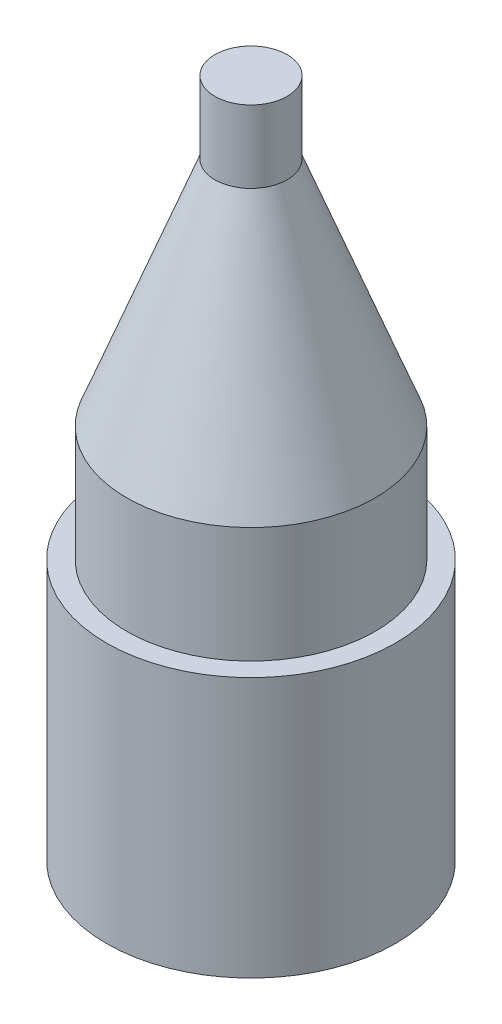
from build123d import *

# Parameters (mm, degrees)
SKETCH1_R      = 12.7
EXTRUDE1_DEPTH = 22.86


with BuildPart() as part:
    # Sketch1 → Extrude1 (new body)
    with BuildSketch(Plane(origin=(0, 0, 0), x_dir=(1, 0, 0), z_dir=(0, 1, 0))):
        with Locations(Location((0, 0, 0), (0, 0, 270))):
            Circle(SKETCH1_R)
    extrude(amount=EXTRUDE1_DEPTH)

    # Sketch2 → Revolve1 (revolve)
    with BuildSketch(Plane.XY, mode=Mode.PRIVATE) as revolve1_sk:
        Polygon((-10.922, 22.86), (-10.922, 33.02), (-3.175, 53.34), (-3.175, 59.69), (0, 59.69), (0, 22.86), align=None)
    revolve(revolve1_sk.sketch.rotate(Axis((0, 0, 0), (0, 1, 0)), 270), axis=Axis((0, 0, 0), (0, 1, 0)))


solid = part.part
